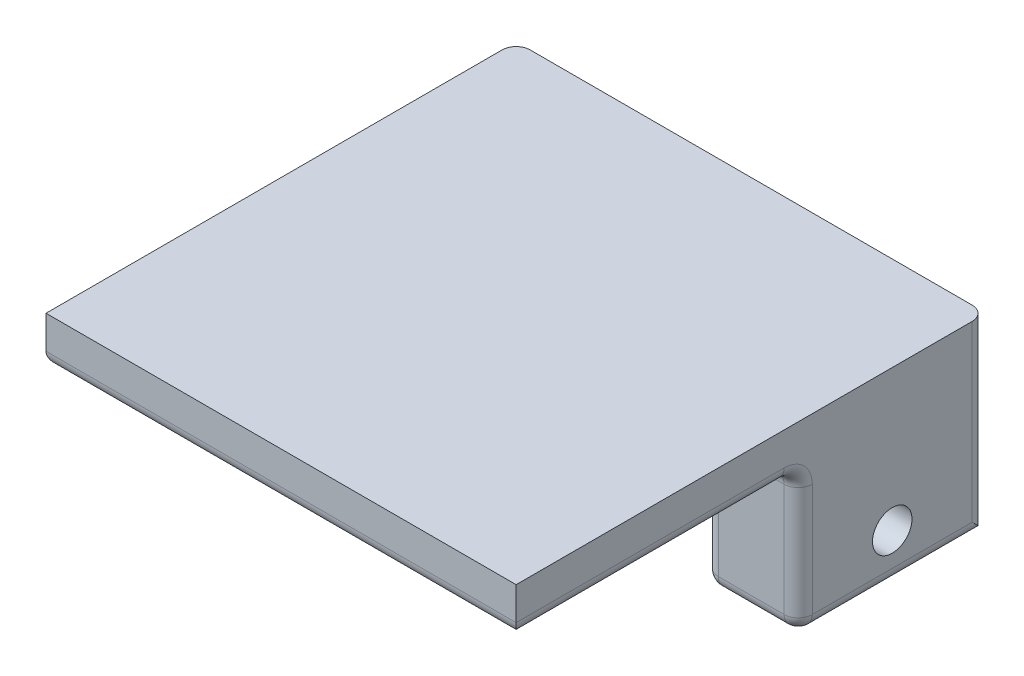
ISO-10303-21;
HEADER;
FILE_DESCRIPTION(('STEP AP214'),'2;1');
FILE_NAME('part.step','',(''),(''),'','','');
FILE_SCHEMA(('AUTOMOTIVE_DESIGN { 1 0 10303 214 1 1 1 1 }'));
ENDSEC;
DATA;
#1=APPLICATION_CONTEXT('core data for automotive mechanical design processes');
#2=APPLICATION_PROTOCOL_DEFINITION('international standard','automotive_design',2000,#1);
#3=PRODUCT_CONTEXT('',#1,'mechanical');
#4=PRODUCT('Part','Part','',(#3));
#5=PRODUCT_RELATED_PRODUCT_CATEGORY('part','',(#4));
#6=PRODUCT_DEFINITION_FORMATION('','',#4);
#7=PRODUCT_DEFINITION_CONTEXT('part definition',#1,'design');
#8=PRODUCT_DEFINITION('design','',#6,#7);
#9=PRODUCT_DEFINITION_SHAPE('','',#8);
#10=(LENGTH_UNIT() NAMED_UNIT(*) SI_UNIT(.MILLI.,.METRE.));
#11=(NAMED_UNIT(*) PLANE_ANGLE_UNIT() SI_UNIT($,.RADIAN.));
#12=(NAMED_UNIT(*) SI_UNIT($,.STERADIAN.) SOLID_ANGLE_UNIT());
#13=UNCERTAINTY_MEASURE_WITH_UNIT(LENGTH_MEASURE(1.E-05),#10,'distance_accuracy_value','');
#14=(GEOMETRIC_REPRESENTATION_CONTEXT(3) GLOBAL_UNCERTAINTY_ASSIGNED_CONTEXT((#13)) GLOBAL_UNIT_ASSIGNED_CONTEXT((#10,
#11,#12)) REPRESENTATION_CONTEXT('',''));
#15=CARTESIAN_POINT('',(0.,0.,0.));
#16=DIRECTION('',(0.,0.,1.));
#17=DIRECTION('',(1.,0.,0.));
#18=AXIS2_PLACEMENT_3D('',#15,#16,#17);
#19=CARTESIAN_POINT('',(0.,0.,0.));
#20=DIRECTION('',(0.,1.,0.));
#21=DIRECTION('',(0.,0.,1.));
#22=AXIS2_PLACEMENT_3D('',#19,#20,#21);
#23=PLANE('',#22);
#24=DIRECTION('',(0.,0.,-1.));
#25=VECTOR('',#24,1.);
#26=CARTESIAN_POINT('',(0.499999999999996,0.,-25.));
#27=LINE('',#26,#25);
#28=CARTESIAN_POINT('',(0.500000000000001,0.,23.5));
#29=VERTEX_POINT('',#28);
#30=CARTESIAN_POINT('',(0.499999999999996,0.,-23.5));
#31=VERTEX_POINT('',#30);
#32=EDGE_CURVE('E503',#29,#31,#27,.T.);
#33=ORIENTED_EDGE('',*,*,#32,.T.);
#34=DIRECTION('',(-1.,0.,0.));
#35=VECTOR('',#34,1.);
#36=CARTESIAN_POINT('',(0.,0.,-23.5));
#37=LINE('',#36,#35);
#38=CARTESIAN_POINT('',(13.5,0.,-23.5));
#39=VERTEX_POINT('',#38);
#40=EDGE_CURVE('E342',#31,#39,#37,.F.);
#41=ORIENTED_EDGE('',*,*,#40,.T.);
#42=DIRECTION('',(0.,0.,-1.));
#43=VECTOR('',#42,1.);
#44=CARTESIAN_POINT('',(13.5,0.,-5.));
#45=LINE('',#44,#43);
#46=CARTESIAN_POINT('',(13.5,0.,-6.5));
#47=VERTEX_POINT('',#46);
#48=EDGE_CURVE('E340',#39,#47,#45,.F.);
#49=ORIENTED_EDGE('',*,*,#48,.T.);
#50=CARTESIAN_POINT('',(16.5,0.,-6.5));
#51=DIRECTION('',(0.,1.,0.));
#52=DIRECTION('',(0.,0.,1.));
#53=AXIS2_PLACEMENT_3D('',#50,#51,#52);
#54=CIRCLE('',#53,3.);
#55=CARTESIAN_POINT('',(16.5,0.,-3.5));
#56=VERTEX_POINT('',#55);
#57=EDGE_CURVE('E337',#56,#47,#54,.F.);
#58=ORIENTED_EDGE('',*,*,#57,.F.);
#59=DIRECTION('',(-1.,0.,0.));
#60=VECTOR('',#59,1.);
#61=CARTESIAN_POINT('',(25.,0.,-3.49999999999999));
#62=LINE('',#61,#60);
#63=CARTESIAN_POINT('',(23.5,0.,-3.5));
#64=VERTEX_POINT('',#63);
#65=EDGE_CURVE('E333',#56,#64,#62,.F.);
#66=ORIENTED_EDGE('',*,*,#65,.T.);
#67=DIRECTION('',(0.,0.,-1.));
#68=VECTOR('',#67,1.);
#69=CARTESIAN_POINT('',(23.5,0.,0.));
#70=LINE('',#69,#68);
#71=CARTESIAN_POINT('',(23.5,0.,23.5));
#72=VERTEX_POINT('',#71);
#73=EDGE_CURVE('E331',#64,#72,#70,.F.);
#74=ORIENTED_EDGE('',*,*,#73,.T.);
#75=DIRECTION('',(1.,0.,0.));
#76=VECTOR('',#75,1.);
#77=CARTESIAN_POINT('',(0.,0.,23.5));
#78=LINE('',#77,#76);
#79=EDGE_CURVE('E335',#72,#29,#78,.F.);
#80=ORIENTED_EDGE('',*,*,#79,.T.);
#81=EDGE_LOOP('',(#33,#41,#49,#58,#66,#74,#80));
#82=FACE_BOUND('',#81,.T.);
#83=ADVANCED_FACE('F38',(#82),#23,.F.);
#84=DIRECTION('',(0.,0.,1.));
#85=VECTOR('',#84,1.);
#86=CARTESIAN_POINT('',(-13.5,0.,-25.));
#87=LINE('',#86,#85);
#88=CARTESIAN_POINT('',(-13.5,0.,-6.5));
#89=VERTEX_POINT('',#88);
#90=CARTESIAN_POINT('',(-13.5,0.,-23.5));
#91=VERTEX_POINT('',#90);
#92=EDGE_CURVE('E299',#89,#91,#87,.F.);
#93=ORIENTED_EDGE('',*,*,#92,.T.);
#94=DIRECTION('',(-1.,0.,0.));
#95=VECTOR('',#94,1.);
#96=CARTESIAN_POINT('',(0.,0.,-23.5));
#97=LINE('',#96,#95);
#98=CARTESIAN_POINT('',(-0.499999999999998,0.,-23.5));
#99=VERTEX_POINT('',#98);
#100=EDGE_CURVE('E301',#91,#99,#97,.F.);
#101=ORIENTED_EDGE('',*,*,#100,.T.);
#102=DIRECTION('',(0.,0.,1.));
#103=VECTOR('',#102,1.);
#104=CARTESIAN_POINT('',(-0.499999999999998,0.,25.));
#105=LINE('',#104,#103);
#106=CARTESIAN_POINT('',(-0.499999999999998,0.,23.5));
#107=VERTEX_POINT('',#106);
#108=EDGE_CURVE('E508',#99,#107,#105,.T.);
#109=ORIENTED_EDGE('',*,*,#108,.T.);
#110=DIRECTION('',(1.,0.,0.));
#111=VECTOR('',#110,1.);
#112=CARTESIAN_POINT('',(-12.75,0.,23.5));
#113=LINE('',#112,#111);
#114=CARTESIAN_POINT('',(-23.5,0.,23.5));
#115=VERTEX_POINT('',#114);
#116=EDGE_CURVE('E292',#107,#115,#113,.F.);
#117=ORIENTED_EDGE('',*,*,#116,.T.);
#118=DIRECTION('',(0.,0.,1.));
#119=VECTOR('',#118,1.);
#120=CARTESIAN_POINT('',(-23.5,0.,0.));
#121=LINE('',#120,#119);
#122=CARTESIAN_POINT('',(-23.5,0.,-3.5));
#123=VERTEX_POINT('',#122);
#124=EDGE_CURVE('E290',#115,#123,#121,.F.);
#125=ORIENTED_EDGE('',*,*,#124,.T.);
#126=DIRECTION('',(-1.,0.,0.));
#127=VECTOR('',#126,1.);
#128=CARTESIAN_POINT('',(-15.,0.,-3.5));
#129=LINE('',#128,#127);
#130=CARTESIAN_POINT('',(-16.5,0.,-3.5));
#131=VERTEX_POINT('',#130);
#132=EDGE_CURVE('E294',#123,#131,#129,.F.);
#133=ORIENTED_EDGE('',*,*,#132,.T.);
#134=CARTESIAN_POINT('',(-16.5,0.,-6.5));
#135=DIRECTION('',(0.,1.,0.));
#136=DIRECTION('',(0.,0.,1.));
#137=AXIS2_PLACEMENT_3D('',#134,#135,#136);
#138=CIRCLE('',#137,3.);
#139=EDGE_CURVE('E296',#89,#131,#138,.F.);
#140=ORIENTED_EDGE('',*,*,#139,.F.);
#141=EDGE_LOOP('',(#93,#101,#109,#117,#125,#133,#140));
#142=FACE_BOUND('',#141,.T.);
#143=ADVANCED_FACE('F597',(#142),#23,.F.);
#144=CARTESIAN_POINT('',(-25.,5.,-25.));
#145=DIRECTION('',(0.,0.,1.));
#146=DIRECTION('',(1.,0.,0.));
#147=AXIS2_PLACEMENT_3D('',#144,#145,#146);
#148=PLANE('',#147);
#149=DIRECTION('',(1.,0.,0.));
#150=VECTOR('',#149,1.);
#151=CARTESIAN_POINT('',(-25.,-15.,-25.));
#152=LINE('',#151,#150);
#153=CARTESIAN_POINT('',(-23.5,-15.,-25.));
#154=VERTEX_POINT('',#153);
#155=CARTESIAN_POINT('',(-16.5,-15.,-25.));
#156=VERTEX_POINT('',#155);
#157=EDGE_CURVE('E530',#154,#156,#152,.T.);
#158=ORIENTED_EDGE('',*,*,#157,.F.);
#159=DIRECTION('',(0.,-1.,0.));
#160=VECTOR('',#159,1.);
#161=CARTESIAN_POINT('',(-23.5,5.,-25.));
#162=LINE('',#161,#160);
#163=CARTESIAN_POINT('',(-23.5,5.,-25.));
#164=VERTEX_POINT('',#163);
#165=EDGE_CURVE('E288',#154,#164,#162,.F.);
#166=ORIENTED_EDGE('',*,*,#165,.T.);
#167=DIRECTION('',(-1.,0.,0.));
#168=VECTOR('',#167,1.);
#169=CARTESIAN_POINT('',(-25.,5.,-25.));
#170=LINE('',#169,#168);
#171=CARTESIAN_POINT('',(23.5,5.,-25.));
#172=VERTEX_POINT('',#171);
#173=EDGE_CURVE('E250',#172,#164,#170,.T.);
#174=ORIENTED_EDGE('',*,*,#173,.F.);
#175=DIRECTION('',(0.,-1.,0.));
#176=VECTOR('',#175,1.);
#177=CARTESIAN_POINT('',(23.5,5.,-25.));
#178=LINE('',#177,#176);
#179=CARTESIAN_POINT('',(23.5,-15.,-25.));
#180=VERTEX_POINT('',#179);
#181=EDGE_CURVE('E259',#172,#180,#178,.T.);
#182=ORIENTED_EDGE('',*,*,#181,.T.);
#183=DIRECTION('',(1.,0.,0.));
#184=VECTOR('',#183,1.);
#185=CARTESIAN_POINT('',(25.,-15.,-25.));
#186=LINE('',#185,#184);
#187=CARTESIAN_POINT('',(16.5,-15.,-25.));
#188=VERTEX_POINT('',#187);
#189=EDGE_CURVE('E527',#188,#180,#186,.T.);
#190=ORIENTED_EDGE('',*,*,#189,.F.);
#191=DIRECTION('',(0.,1.,0.));
#192=VECTOR('',#191,1.);
#193=CARTESIAN_POINT('',(16.5,5.,-25.));
#194=LINE('',#193,#192);
#195=CARTESIAN_POINT('',(16.5,-1.5,-25.));
#196=VERTEX_POINT('',#195);
#197=EDGE_CURVE('E286',#188,#196,#194,.T.);
#198=ORIENTED_EDGE('',*,*,#197,.T.);
#199=CARTESIAN_POINT('',(13.5,-1.5,-25.));
#200=DIRECTION('',(0.,0.,1.));
#201=DIRECTION('',(1.,0.,0.));
#202=AXIS2_PLACEMENT_3D('',#199,#200,#201);
#203=CIRCLE('',#202,3.);
#204=CARTESIAN_POINT('',(13.5,1.5,-25.));
#205=VERTEX_POINT('',#204);
#206=EDGE_CURVE('E283',#205,#196,#203,.F.);
#207=ORIENTED_EDGE('',*,*,#206,.F.);
#208=DIRECTION('',(-1.,0.,0.));
#209=VECTOR('',#208,1.);
#210=CARTESIAN_POINT('',(-25.,1.5,-25.));
#211=LINE('',#210,#209);
#212=CARTESIAN_POINT('',(-13.5,1.5,-25.));
#213=VERTEX_POINT('',#212);
#214=EDGE_CURVE('E280',#205,#213,#211,.T.);
#215=ORIENTED_EDGE('',*,*,#214,.T.);
#216=CARTESIAN_POINT('',(-13.5,-1.5,-25.));
#217=DIRECTION('',(0.,0.,1.));
#218=DIRECTION('',(1.,0.,0.));
#219=AXIS2_PLACEMENT_3D('',#216,#217,#218);
#220=CIRCLE('',#219,3.);
#221=CARTESIAN_POINT('',(-16.5,-1.5,-25.));
#222=VERTEX_POINT('',#221);
#223=EDGE_CURVE('E277',#222,#213,#220,.F.);
#224=ORIENTED_EDGE('',*,*,#223,.F.);
#225=DIRECTION('',(0.,1.,0.));
#226=VECTOR('',#225,1.);
#227=CARTESIAN_POINT('',(-16.5,5.,-25.));
#228=LINE('',#227,#226);
#229=EDGE_CURVE('E275',#222,#156,#228,.F.);
#230=ORIENTED_EDGE('',*,*,#229,.T.);
#231=EDGE_LOOP('',(#158,#166,#174,#182,#190,#198,#207,#215,#224,#230));
#232=FACE_BOUND('',#231,.T.);
#233=ADVANCED_FACE('F595',(#232),#148,.F.);
#234=CARTESIAN_POINT('',(-25.,5.,25.));
#235=DIRECTION('',(0.,0.,-1.));
#236=DIRECTION('',(-1.,0.,0.));
#237=AXIS2_PLACEMENT_3D('',#234,#235,#236);
#238=PLANE('',#237);
#239=DIRECTION('',(0.,-1.,0.));
#240=VECTOR('',#239,1.);
#241=CARTESIAN_POINT('',(-25.,5.,25.));
#242=LINE('',#241,#240);
#243=CARTESIAN_POINT('',(-25.,5.,25.));
#244=VERTEX_POINT('',#243);
#245=CARTESIAN_POINT('',(-25.,1.5,25.));
#246=VERTEX_POINT('',#245);
#247=EDGE_CURVE('E253',#244,#246,#242,.T.);
#248=ORIENTED_EDGE('',*,*,#247,.T.);
#249=DIRECTION('',(1.,0.,0.));
#250=VECTOR('',#249,1.);
#251=CARTESIAN_POINT('',(-25.,1.5,25.));
#252=LINE('',#251,#250);
#253=CARTESIAN_POINT('',(25.,1.5,25.));
#254=VERTEX_POINT('',#253);
#255=EDGE_CURVE('E360',#246,#254,#252,.T.);
#256=ORIENTED_EDGE('',*,*,#255,.T.);
#257=DIRECTION('',(0.,-1.,0.));
#258=VECTOR('',#257,1.);
#259=CARTESIAN_POINT('',(25.,5.,25.));
#260=LINE('',#259,#258);
#261=CARTESIAN_POINT('',(25.,5.,25.));
#262=VERTEX_POINT('',#261);
#263=EDGE_CURVE('E260',#262,#254,#260,.T.);
#264=ORIENTED_EDGE('',*,*,#263,.F.);
#265=DIRECTION('',(1.,0.,0.));
#266=VECTOR('',#265,1.);
#267=CARTESIAN_POINT('',(-25.,5.,25.));
#268=LINE('',#267,#266);
#269=EDGE_CURVE('E244',#244,#262,#268,.T.);
#270=ORIENTED_EDGE('',*,*,#269,.F.);
#271=EDGE_LOOP('',(#248,#256,#264,#270));
#272=FACE_BOUND('',#271,.T.);
#273=ADVANCED_FACE('F262',(#272),#238,.F.);
#274=CARTESIAN_POINT('',(25.,5.,-25.));
#275=DIRECTION('',(-1.,0.,0.));
#276=DIRECTION('',(0.,0.,1.));
#277=AXIS2_PLACEMENT_3D('',#274,#275,#276);
#278=PLANE('',#277);
#279=CARTESIAN_POINT('',(25.,-10.,-15.));
#280=DIRECTION('',(-1.,0.,0.));
#281=DIRECTION('',(0.,0.,1.));
#282=AXIS2_PLACEMENT_3D('',#279,#280,#281);
#283=CIRCLE('',#282,2.1);
#284=CARTESIAN_POINT('',(25.,-10.,-12.9));
#285=VERTEX_POINT('',#284);
#286=EDGE_CURVE('E524',#285,#285,#283,.T.);
#287=ORIENTED_EDGE('',*,*,#286,.T.);
#288=EDGE_LOOP('',(#287));
#289=FACE_BOUND('',#288,.T.);
#290=DIRECTION('',(0.,0.,1.));
#291=VECTOR('',#290,1.);
#292=CARTESIAN_POINT('',(25.,-13.5,-25.));
#293=LINE('',#292,#291);
#294=CARTESIAN_POINT('',(25.,-13.5,-6.5));
#295=VERTEX_POINT('',#294);
#296=CARTESIAN_POINT('',(25.,-13.5,-23.5));
#297=VERTEX_POINT('',#296);
#298=EDGE_CURVE('E47',#295,#297,#293,.F.);
#299=ORIENTED_EDGE('',*,*,#298,.T.);
#300=DIRECTION('',(0.,-1.,0.));
#301=VECTOR('',#300,1.);
#302=CARTESIAN_POINT('',(25.,5.,-23.5));
#303=LINE('',#302,#301);
#304=CARTESIAN_POINT('',(25.,5.,-23.5));
#305=VERTEX_POINT('',#304);
#306=EDGE_CURVE('E11',#297,#305,#303,.F.);
#307=ORIENTED_EDGE('',*,*,#306,.T.);
#308=DIRECTION('',(0.,0.,-1.));
#309=VECTOR('',#308,1.);
#310=CARTESIAN_POINT('',(25.,5.,-25.));
#311=LINE('',#310,#309);
#312=EDGE_CURVE('E533',#262,#305,#311,.T.);
#313=ORIENTED_EDGE('',*,*,#312,.F.);
#314=ORIENTED_EDGE('',*,*,#263,.T.);
#315=DIRECTION('',(0.,0.,-1.));
#316=VECTOR('',#315,1.);
#317=CARTESIAN_POINT('',(25.,1.5,-25.));
#318=LINE('',#317,#316);
#319=CARTESIAN_POINT('',(25.,1.5,-3.5));
#320=VERTEX_POINT('',#319);
#321=EDGE_CURVE('E396',#254,#320,#318,.T.);
#322=ORIENTED_EDGE('',*,*,#321,.T.);
#323=CARTESIAN_POINT('',(25.,-1.5,-3.5));
#324=DIRECTION('',(-1.,0.,0.));
#325=DIRECTION('',(0.,0.,1.));
#326=AXIS2_PLACEMENT_3D('',#323,#324,#325);
#327=CIRCLE('',#326,3.);
#328=CARTESIAN_POINT('',(25.,-1.5,-6.5));
#329=VERTEX_POINT('',#328);
#330=EDGE_CURVE('E393',#329,#320,#327,.F.);
#331=ORIENTED_EDGE('',*,*,#330,.F.);
#332=DIRECTION('',(0.,1.,0.));
#333=VECTOR('',#332,1.);
#334=CARTESIAN_POINT('',(25.,5.,-6.5));
#335=LINE('',#334,#333);
#336=EDGE_CURVE('E58',#329,#295,#335,.F.);
#337=ORIENTED_EDGE('',*,*,#336,.T.);
#338=EDGE_LOOP('',(#299,#307,#313,#314,#322,#331,#337));
#339=FACE_BOUND('',#338,.T.);
#340=ADVANCED_FACE('F572',(#289,#339),#278,.F.);
#341=CARTESIAN_POINT('',(-25.,5.,-25.));
#342=DIRECTION('',(1.,0.,0.));
#343=DIRECTION('',(0.,0.,-1.));
#344=AXIS2_PLACEMENT_3D('',#341,#342,#343);
#345=PLANE('',#344);
#346=CARTESIAN_POINT('',(-25.,-10.,-15.));
#347=DIRECTION('',(1.,0.,0.));
#348=DIRECTION('',(0.,0.,-1.));
#349=AXIS2_PLACEMENT_3D('',#346,#347,#348);
#350=CIRCLE('',#349,2.1);
#351=CARTESIAN_POINT('',(-25.,-10.,-17.1));
#352=VERTEX_POINT('',#351);
#353=EDGE_CURVE('E273',#352,#352,#350,.T.);
#354=ORIENTED_EDGE('',*,*,#353,.T.);
#355=EDGE_LOOP('',(#354));
#356=FACE_BOUND('',#355,.T.);
#357=CARTESIAN_POINT('',(-25.,-1.5,-3.5));
#358=DIRECTION('',(1.,0.,0.));
#359=DIRECTION('',(0.,0.,-1.));
#360=AXIS2_PLACEMENT_3D('',#357,#358,#359);
#361=CIRCLE('',#360,3.);
#362=CARTESIAN_POINT('',(-25.,1.5,-3.5));
#363=VERTEX_POINT('',#362);
#364=CARTESIAN_POINT('',(-25.,-1.5,-6.5));
#365=VERTEX_POINT('',#364);
#366=EDGE_CURVE('E356',#363,#365,#361,.F.);
#367=ORIENTED_EDGE('',*,*,#366,.F.);
#368=DIRECTION('',(0.,0.,1.));
#369=VECTOR('',#368,1.);
#370=CARTESIAN_POINT('',(-25.,1.5,-25.));
#371=LINE('',#370,#369);
#372=EDGE_CURVE('E256',#363,#246,#371,.T.);
#373=ORIENTED_EDGE('',*,*,#372,.T.);
#374=ORIENTED_EDGE('',*,*,#247,.F.);
#375=DIRECTION('',(0.,0.,1.));
#376=VECTOR('',#375,1.);
#377=CARTESIAN_POINT('',(-25.,5.,-25.));
#378=LINE('',#377,#376);
#379=CARTESIAN_POINT('',(-25.,5.,-23.5));
#380=VERTEX_POINT('',#379);
#381=EDGE_CURVE('E238',#380,#244,#378,.T.);
#382=ORIENTED_EDGE('',*,*,#381,.F.);
#383=DIRECTION('',(0.,-1.,0.));
#384=VECTOR('',#383,1.);
#385=CARTESIAN_POINT('',(-25.,5.,-23.5));
#386=LINE('',#385,#384);
#387=CARTESIAN_POINT('',(-25.,-13.5,-23.5));
#388=VERTEX_POINT('',#387);
#389=EDGE_CURVE('E350',#380,#388,#386,.T.);
#390=ORIENTED_EDGE('',*,*,#389,.T.);
#391=DIRECTION('',(0.,0.,-1.));
#392=VECTOR('',#391,1.);
#393=CARTESIAN_POINT('',(-25.,-13.5,-5.));
#394=LINE('',#393,#392);
#395=CARTESIAN_POINT('',(-25.,-13.5,-6.5));
#396=VERTEX_POINT('',#395);
#397=EDGE_CURVE('E352',#388,#396,#394,.F.);
#398=ORIENTED_EDGE('',*,*,#397,.T.);
#399=DIRECTION('',(0.,1.,0.));
#400=VECTOR('',#399,1.);
#401=CARTESIAN_POINT('',(-25.,5.,-6.5));
#402=LINE('',#401,#400);
#403=EDGE_CURVE('E354',#396,#365,#402,.T.);
#404=ORIENTED_EDGE('',*,*,#403,.T.);
#405=EDGE_LOOP('',(#367,#373,#374,#382,#390,#398,#404));
#406=FACE_BOUND('',#405,.T.);
#407=ADVANCED_FACE('F254',(#356,#406),#345,.F.);
#408=CARTESIAN_POINT('',(0.,5.,0.));
#409=DIRECTION('',(0.,1.,0.));
#410=DIRECTION('',(0.,0.,1.));
#411=AXIS2_PLACEMENT_3D('',#408,#409,#410);
#412=PLANE('',#411);
#413=ORIENTED_EDGE('',*,*,#173,.T.);
#414=CARTESIAN_POINT('',(-23.5,5.,-23.5));
#415=DIRECTION('',(0.,1.,0.));
#416=DIRECTION('',(0.,0.,1.));
#417=AXIS2_PLACEMENT_3D('',#414,#415,#416);
#418=CIRCLE('',#417,1.5);
#419=EDGE_CURVE('E247',#164,#380,#418,.T.);
#420=ORIENTED_EDGE('',*,*,#419,.T.);
#421=ORIENTED_EDGE('',*,*,#381,.T.);
#422=ORIENTED_EDGE('',*,*,#269,.T.);
#423=ORIENTED_EDGE('',*,*,#312,.T.);
#424=CARTESIAN_POINT('',(23.5,5.,-23.5));
#425=DIRECTION('',(0.,1.,0.));
#426=DIRECTION('',(0.,0.,1.));
#427=AXIS2_PLACEMENT_3D('',#424,#425,#426);
#428=CIRCLE('',#427,1.5);
#429=EDGE_CURVE('E390',#305,#172,#428,.T.);
#430=ORIENTED_EDGE('',*,*,#429,.T.);
#431=EDGE_LOOP('',(#413,#420,#421,#422,#423,#430));
#432=FACE_BOUND('',#431,.T.);
#433=ADVANCED_FACE('F241',(#432),#412,.T.);
#434=CARTESIAN_POINT('',(-15.,-15.,-5.));
#435=DIRECTION('',(-1.,0.,0.));
#436=DIRECTION('',(0.,0.,1.));
#437=AXIS2_PLACEMENT_3D('',#434,#435,#436);
#438=PLANE('',#437);
#439=DIRECTION('',(0.,1.,0.));
#440=VECTOR('',#439,1.);
#441=CARTESIAN_POINT('',(-15.,-15.,-23.5));
#442=LINE('',#441,#440);
#443=CARTESIAN_POINT('',(-15.,-13.5,-23.5));
#444=VERTEX_POINT('',#443);
#445=CARTESIAN_POINT('',(-15.,-1.5,-23.5));
#446=VERTEX_POINT('',#445);
#447=EDGE_CURVE('E366',#444,#446,#442,.T.);
#448=ORIENTED_EDGE('',*,*,#447,.T.);
#449=DIRECTION('',(0.,0.,1.));
#450=VECTOR('',#449,1.);
#451=CARTESIAN_POINT('',(-15.,-1.5,-5.));
#452=LINE('',#451,#450);
#453=CARTESIAN_POINT('',(-15.,-1.5,-6.5));
#454=VERTEX_POINT('',#453);
#455=EDGE_CURVE('E372',#446,#454,#452,.T.);
#456=ORIENTED_EDGE('',*,*,#455,.T.);
#457=DIRECTION('',(0.,1.,0.));
#458=VECTOR('',#457,1.);
#459=CARTESIAN_POINT('',(-15.,-15.,-6.5));
#460=LINE('',#459,#458);
#461=CARTESIAN_POINT('',(-15.,-13.5,-6.5));
#462=VERTEX_POINT('',#461);
#463=EDGE_CURVE('E370',#454,#462,#460,.F.);
#464=ORIENTED_EDGE('',*,*,#463,.T.);
#465=DIRECTION('',(0.,0.,1.));
#466=VECTOR('',#465,1.);
#467=CARTESIAN_POINT('',(-15.,-13.5,-25.));
#468=LINE('',#467,#466);
#469=EDGE_CURVE('E368',#462,#444,#468,.F.);
#470=ORIENTED_EDGE('',*,*,#469,.T.);
#471=EDGE_LOOP('',(#448,#456,#464,#470));
#472=FACE_BOUND('',#471,.T.);
#473=CARTESIAN_POINT('',(-15.,-10.,-15.));
#474=DIRECTION('',(-1.,0.,0.));
#475=DIRECTION('',(0.,0.,1.));
#476=AXIS2_PLACEMENT_3D('',#473,#474,#475);
#477=CIRCLE('',#476,2.1);
#478=CARTESIAN_POINT('',(-15.,-10.,-12.9));
#479=VERTEX_POINT('',#478);
#480=EDGE_CURVE('E272',#479,#479,#477,.T.);
#481=ORIENTED_EDGE('',*,*,#480,.T.);
#482=EDGE_LOOP('',(#481));
#483=FACE_BOUND('',#482,.T.);
#484=ADVANCED_FACE('F619',(#472,#483),#438,.F.);
#485=CARTESIAN_POINT('',(-25.,-15.,-5.));
#486=DIRECTION('',(0.,0.,-1.));
#487=DIRECTION('',(-1.,0.,0.));
#488=AXIS2_PLACEMENT_3D('',#485,#486,#487);
#489=PLANE('',#488);
#490=DIRECTION('',(-1.,0.,0.));
#491=VECTOR('',#490,1.);
#492=CARTESIAN_POINT('',(-15.,-13.5,-5.));
#493=LINE('',#492,#491);
#494=CARTESIAN_POINT('',(-23.5,-13.5,-5.));
#495=VERTEX_POINT('',#494);
#496=CARTESIAN_POINT('',(-16.5,-13.5,-5.));
#497=VERTEX_POINT('',#496);
#498=EDGE_CURVE('E315',#495,#497,#493,.F.);
#499=ORIENTED_EDGE('',*,*,#498,.T.);
#500=DIRECTION('',(0.,1.,0.));
#501=VECTOR('',#500,1.);
#502=CARTESIAN_POINT('',(-16.5,-15.,-5.));
#503=LINE('',#502,#501);
#504=CARTESIAN_POINT('',(-16.5,-1.5,-5.));
#505=VERTEX_POINT('',#504);
#506=EDGE_CURVE('E320',#497,#505,#503,.T.);
#507=ORIENTED_EDGE('',*,*,#506,.T.);
#508=DIRECTION('',(-1.,0.,0.));
#509=VECTOR('',#508,1.);
#510=CARTESIAN_POINT('',(-25.,-1.5,-5.));
#511=LINE('',#510,#509);
#512=CARTESIAN_POINT('',(-23.5,-1.5,-5.));
#513=VERTEX_POINT('',#512);
#514=EDGE_CURVE('E317',#505,#513,#511,.T.);
#515=ORIENTED_EDGE('',*,*,#514,.T.);
#516=DIRECTION('',(0.,1.,0.));
#517=VECTOR('',#516,1.);
#518=CARTESIAN_POINT('',(-23.5,-15.,-5.));
#519=LINE('',#518,#517);
#520=EDGE_CURVE('E313',#513,#495,#519,.F.);
#521=ORIENTED_EDGE('',*,*,#520,.T.);
#522=EDGE_LOOP('',(#499,#507,#515,#521));
#523=FACE_BOUND('',#522,.T.);
#524=ADVANCED_FACE('F632',(#523),#489,.F.);
#525=CARTESIAN_POINT('',(0.,-15.,0.));
#526=DIRECTION('',(0.,-1.,0.));
#527=DIRECTION('',(0.,0.,-1.));
#528=AXIS2_PLACEMENT_3D('',#525,#526,#527);
#529=PLANE('',#528);
#530=DIRECTION('',(-1.,0.,0.));
#531=VECTOR('',#530,1.);
#532=CARTESIAN_POINT('',(-25.,-15.,-6.5));
#533=LINE('',#532,#531);
#534=CARTESIAN_POINT('',(-16.5,-15.,-6.5));
#535=VERTEX_POINT('',#534);
#536=CARTESIAN_POINT('',(-23.5,-15.,-6.5));
#537=VERTEX_POINT('',#536);
#538=EDGE_CURVE('E346',#535,#537,#533,.T.);
#539=ORIENTED_EDGE('',*,*,#538,.T.);
#540=DIRECTION('',(0.,0.,-1.));
#541=VECTOR('',#540,1.);
#542=CARTESIAN_POINT('',(-23.5,-15.,-25.));
#543=LINE('',#542,#541);
#544=EDGE_CURVE('E348',#537,#154,#543,.T.);
#545=ORIENTED_EDGE('',*,*,#544,.T.);
#546=ORIENTED_EDGE('',*,*,#157,.T.);
#547=DIRECTION('',(0.,0.,1.));
#548=VECTOR('',#547,1.);
#549=CARTESIAN_POINT('',(-16.5,-15.,-5.));
#550=LINE('',#549,#548);
#551=EDGE_CURVE('E344',#156,#535,#550,.T.);
#552=ORIENTED_EDGE('',*,*,#551,.T.);
#553=EDGE_LOOP('',(#539,#545,#546,#552));
#554=FACE_BOUND('',#553,.T.);
#555=ADVANCED_FACE('F637',(#554),#529,.T.);
#556=CARTESIAN_POINT('',(25.,-15.,-4.99999999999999));
#557=DIRECTION('',(0.,0.,-1.));
#558=DIRECTION('',(-1.,0.,0.));
#559=AXIS2_PLACEMENT_3D('',#556,#557,#558);
#560=PLANE('',#559);
#561=DIRECTION('',(0.,1.,0.));
#562=VECTOR('',#561,1.);
#563=CARTESIAN_POINT('',(16.5,-15.,-5.));
#564=LINE('',#563,#562);
#565=CARTESIAN_POINT('',(16.5,-1.5,-5.));
#566=VERTEX_POINT('',#565);
#567=CARTESIAN_POINT('',(16.5,-13.5,-5.));
#568=VERTEX_POINT('',#567);
#569=EDGE_CURVE('E385',#566,#568,#564,.F.);
#570=ORIENTED_EDGE('',*,*,#569,.T.);
#571=DIRECTION('',(-1.,0.,0.));
#572=VECTOR('',#571,1.);
#573=CARTESIAN_POINT('',(25.,-13.5,-4.99999999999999));
#574=LINE('',#573,#572);
#575=CARTESIAN_POINT('',(23.5,-13.5,-5.));
#576=VERTEX_POINT('',#575);
#577=EDGE_CURVE('E387',#568,#576,#574,.F.);
#578=ORIENTED_EDGE('',*,*,#577,.T.);
#579=DIRECTION('',(0.,1.,0.));
#580=VECTOR('',#579,1.);
#581=CARTESIAN_POINT('',(23.5,-15.,-5.));
#582=LINE('',#581,#580);
#583=CARTESIAN_POINT('',(23.5,-1.5,-5.));
#584=VERTEX_POINT('',#583);
#585=EDGE_CURVE('E381',#576,#584,#582,.T.);
#586=ORIENTED_EDGE('',*,*,#585,.T.);
#587=DIRECTION('',(-1.,0.,0.));
#588=VECTOR('',#587,1.);
#589=CARTESIAN_POINT('',(15.,-1.5,-5.));
#590=LINE('',#589,#588);
#591=EDGE_CURVE('E383',#584,#566,#590,.T.);
#592=ORIENTED_EDGE('',*,*,#591,.T.);
#593=EDGE_LOOP('',(#570,#578,#586,#592));
#594=FACE_BOUND('',#593,.T.);
#595=ADVANCED_FACE('F643',(#594),#560,.F.);
#596=CARTESIAN_POINT('',(15.,-15.,-5.));
#597=DIRECTION('',(1.,0.,0.));
#598=DIRECTION('',(0.,0.,-1.));
#599=AXIS2_PLACEMENT_3D('',#596,#597,#598);
#600=PLANE('',#599);
#601=DIRECTION('',(0.,1.,0.));
#602=VECTOR('',#601,1.);
#603=CARTESIAN_POINT('',(15.,-15.,-6.5));
#604=LINE('',#603,#602);
#605=CARTESIAN_POINT('',(15.,-13.5,-6.5));
#606=VERTEX_POINT('',#605);
#607=CARTESIAN_POINT('',(15.,-1.5,-6.5));
#608=VERTEX_POINT('',#607);
#609=EDGE_CURVE('E322',#606,#608,#604,.T.);
#610=ORIENTED_EDGE('',*,*,#609,.T.);
#611=DIRECTION('',(0.,0.,-1.));
#612=VECTOR('',#611,1.);
#613=CARTESIAN_POINT('',(15.,-1.5,-25.));
#614=LINE('',#613,#612);
#615=CARTESIAN_POINT('',(15.,-1.5,-23.5));
#616=VERTEX_POINT('',#615);
#617=EDGE_CURVE('E328',#608,#616,#614,.T.);
#618=ORIENTED_EDGE('',*,*,#617,.T.);
#619=DIRECTION('',(0.,1.,0.));
#620=VECTOR('',#619,1.);
#621=CARTESIAN_POINT('',(15.,-15.,-23.5));
#622=LINE('',#621,#620);
#623=CARTESIAN_POINT('',(15.,-13.5,-23.5));
#624=VERTEX_POINT('',#623);
#625=EDGE_CURVE('E326',#616,#624,#622,.F.);
#626=ORIENTED_EDGE('',*,*,#625,.T.);
#627=DIRECTION('',(0.,0.,-1.));
#628=VECTOR('',#627,1.);
#629=CARTESIAN_POINT('',(15.,-13.5,-5.));
#630=LINE('',#629,#628);
#631=EDGE_CURVE('E324',#624,#606,#630,.F.);
#632=ORIENTED_EDGE('',*,*,#631,.T.);
#633=EDGE_LOOP('',(#610,#618,#626,#632));
#634=FACE_BOUND('',#633,.T.);
#635=CARTESIAN_POINT('',(15.,-10.,-15.));
#636=DIRECTION('',(1.,0.,0.));
#637=DIRECTION('',(0.,0.,-1.));
#638=AXIS2_PLACEMENT_3D('',#635,#636,#637);
#639=CIRCLE('',#638,2.1);
#640=CARTESIAN_POINT('',(15.,-10.,-17.1));
#641=VERTEX_POINT('',#640);
#642=EDGE_CURVE('E269',#641,#641,#639,.T.);
#643=ORIENTED_EDGE('',*,*,#642,.T.);
#644=EDGE_LOOP('',(#643));
#645=FACE_BOUND('',#644,.T.);
#646=ADVANCED_FACE('F647',(#634,#645),#600,.F.);
#647=CARTESIAN_POINT('',(0.,-15.,0.));
#648=DIRECTION('',(0.,1.,0.));
#649=DIRECTION('',(0.,0.,1.));
#650=AXIS2_PLACEMENT_3D('',#647,#648,#649);
#651=PLANE('',#650);
#652=DIRECTION('',(-1.,0.,0.));
#653=VECTOR('',#652,1.);
#654=CARTESIAN_POINT('',(0.,-15.,-6.5));
#655=LINE('',#654,#653);
#656=CARTESIAN_POINT('',(23.5,-15.,-6.5));
#657=VERTEX_POINT('',#656);
#658=CARTESIAN_POINT('',(16.5,-15.,-6.5));
#659=VERTEX_POINT('',#658);
#660=EDGE_CURVE('E377',#657,#659,#655,.T.);
#661=ORIENTED_EDGE('',*,*,#660,.T.);
#662=DIRECTION('',(0.,0.,-1.));
#663=VECTOR('',#662,1.);
#664=CARTESIAN_POINT('',(16.5,-15.,0.));
#665=LINE('',#664,#663);
#666=EDGE_CURVE('E379',#659,#188,#665,.T.);
#667=ORIENTED_EDGE('',*,*,#666,.T.);
#668=ORIENTED_EDGE('',*,*,#189,.T.);
#669=DIRECTION('',(0.,0.,1.));
#670=VECTOR('',#669,1.);
#671=CARTESIAN_POINT('',(23.5,-15.,0.));
#672=LINE('',#671,#670);
#673=EDGE_CURVE('E375',#180,#657,#672,.T.);
#674=ORIENTED_EDGE('',*,*,#673,.T.);
#675=EDGE_LOOP('',(#661,#667,#668,#674));
#676=FACE_BOUND('',#675,.T.);
#677=ADVANCED_FACE('F588',(#676),#651,.F.);
#678=CARTESIAN_POINT('',(-25.,-10.,-15.));
#679=DIRECTION('',(1.,0.,0.));
#680=DIRECTION('',(0.,0.,-1.));
#681=AXIS2_PLACEMENT_3D('',#678,#679,#680);
#682=CYLINDRICAL_SURFACE('',#681,2.1);
#683=ORIENTED_EDGE('',*,*,#642,.F.);
#684=EDGE_LOOP('',(#683));
#685=FACE_BOUND('',#684,.T.);
#686=ORIENTED_EDGE('',*,*,#286,.F.);
#687=EDGE_LOOP('',(#686));
#688=FACE_BOUND('',#687,.T.);
#689=ADVANCED_FACE('F627',(#685,#688),#682,.F.);
#690=ORIENTED_EDGE('',*,*,#353,.F.);
#691=EDGE_LOOP('',(#690));
#692=FACE_BOUND('',#691,.T.);
#693=ORIENTED_EDGE('',*,*,#480,.F.);
#694=EDGE_LOOP('',(#693));
#695=FACE_BOUND('',#694,.T.);
#696=ADVANCED_FACE('F623',(#692,#695),#682,.F.);
#697=CARTESIAN_POINT('',(0.499999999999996,0.5,-25.));
#698=DIRECTION('',(-1.,0.,0.));
#699=DIRECTION('',(0.,0.,1.));
#700=AXIS2_PLACEMENT_3D('',#697,#698,#699);
#701=PLANE('',#700);
#702=ORIENTED_EDGE('',*,*,#32,.F.);
#703=CARTESIAN_POINT('',(0.500000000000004,1.5,23.5));
#704=DIRECTION('',(-1.,0.,0.));
#705=DIRECTION('',(0.,0.,1.));
#706=AXIS2_PLACEMENT_3D('',#703,#704,#705);
#707=CIRCLE('',#706,1.5);
#708=CARTESIAN_POINT('',(0.500000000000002,0.5,24.6180339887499));
#709=VERTEX_POINT('',#708);
#710=EDGE_CURVE('E364',#29,#709,#707,.T.);
#711=ORIENTED_EDGE('',*,*,#710,.T.);
#712=DIRECTION('',(0.,0.,-1.));
#713=VECTOR('',#712,1.);
#714=CARTESIAN_POINT('',(0.499999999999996,0.5,-25.));
#715=LINE('',#714,#713);
#716=CARTESIAN_POINT('',(0.499999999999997,0.5,-24.6180339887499));
#717=VERTEX_POINT('',#716);
#718=EDGE_CURVE('E514',#709,#717,#715,.T.);
#719=ORIENTED_EDGE('',*,*,#718,.T.);
#720=CARTESIAN_POINT('',(0.499999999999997,1.5,-23.5));
#721=DIRECTION('',(-1.,0.,0.));
#722=DIRECTION('',(0.,0.,1.));
#723=AXIS2_PLACEMENT_3D('',#720,#721,#722);
#724=CIRCLE('',#723,1.5);
#725=EDGE_CURVE('E362',#717,#31,#724,.T.);
#726=ORIENTED_EDGE('',*,*,#725,.T.);
#727=EDGE_LOOP('',(#702,#711,#719,#726));
#728=FACE_BOUND('',#727,.T.);
#729=ADVANCED_FACE('F626',(#728),#701,.T.);
#730=CARTESIAN_POINT('',(-0.499999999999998,0.5,25.));
#731=DIRECTION('',(1.,0.,0.));
#732=DIRECTION('',(0.,0.,-1.));
#733=AXIS2_PLACEMENT_3D('',#730,#731,#732);
#734=PLANE('',#733);
#735=ORIENTED_EDGE('',*,*,#108,.F.);
#736=CARTESIAN_POINT('',(-0.499999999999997,1.5,-23.5));
#737=DIRECTION('',(1.,0.,0.));
#738=DIRECTION('',(0.,0.,-1.));
#739=AXIS2_PLACEMENT_3D('',#736,#737,#738);
#740=CIRCLE('',#739,1.5);
#741=CARTESIAN_POINT('',(-0.499999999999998,0.5,-24.6180339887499));
#742=VERTEX_POINT('',#741);
#743=EDGE_CURVE('E306',#99,#742,#740,.T.);
#744=ORIENTED_EDGE('',*,*,#743,.T.);
#745=DIRECTION('',(0.,0.,1.));
#746=VECTOR('',#745,1.);
#747=CARTESIAN_POINT('',(-0.499999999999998,0.5,25.));
#748=LINE('',#747,#746);
#749=CARTESIAN_POINT('',(-0.499999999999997,0.5,24.6180339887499));
#750=VERTEX_POINT('',#749);
#751=EDGE_CURVE('E517',#742,#750,#748,.T.);
#752=ORIENTED_EDGE('',*,*,#751,.T.);
#753=CARTESIAN_POINT('',(-0.499999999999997,1.5,23.5));
#754=DIRECTION('',(1.,0.,0.));
#755=DIRECTION('',(0.,0.,-1.));
#756=AXIS2_PLACEMENT_3D('',#753,#754,#755);
#757=CIRCLE('',#756,1.5);
#758=EDGE_CURVE('E304',#750,#107,#757,.T.);
#759=ORIENTED_EDGE('',*,*,#758,.T.);
#760=EDGE_LOOP('',(#735,#744,#752,#759));
#761=FACE_BOUND('',#760,.T.);
#762=ADVANCED_FACE('F658',(#761),#734,.T.);
#763=CARTESIAN_POINT('',(0.,0.5,0.));
#764=DIRECTION('',(0.,-1.,0.));
#765=DIRECTION('',(0.,0.,-1.));
#766=AXIS2_PLACEMENT_3D('',#763,#764,#765);
#767=PLANE('',#766);
#768=ORIENTED_EDGE('',*,*,#718,.F.);
#769=DIRECTION('',(1.,0.,0.));
#770=VECTOR('',#769,1.);
#771=CARTESIAN_POINT('',(0.500000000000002,0.5,24.6180339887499));
#772=LINE('',#771,#770);
#773=EDGE_CURVE('E311',#709,#750,#772,.F.);
#774=ORIENTED_EDGE('',*,*,#773,.T.);
#775=ORIENTED_EDGE('',*,*,#751,.F.);
#776=DIRECTION('',(-1.,0.,0.));
#777=VECTOR('',#776,1.);
#778=CARTESIAN_POINT('',(-0.499999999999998,0.5,-24.6180339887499));
#779=LINE('',#778,#777);
#780=EDGE_CURVE('E309',#742,#717,#779,.F.);
#781=ORIENTED_EDGE('',*,*,#780,.T.);
#782=EDGE_LOOP('',(#768,#774,#775,#781));
#783=FACE_BOUND('',#782,.T.);
#784=ADVANCED_FACE('F662',(#783),#767,.T.);
#785=CARTESIAN_POINT('',(23.5,5.,-23.5));
#786=DIRECTION('',(0.,-1.,0.));
#787=DIRECTION('',(0.,0.,-1.));
#788=AXIS2_PLACEMENT_3D('',#785,#786,#787);
#789=CYLINDRICAL_SURFACE('',#788,1.5);
#790=ORIENTED_EDGE('',*,*,#429,.F.);
#791=ORIENTED_EDGE('',*,*,#306,.F.);
#792=CARTESIAN_POINT('',(23.5,-13.5,-23.5));
#793=DIRECTION('',(0.,-0.707106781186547,0.707106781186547));
#794=DIRECTION('',(0.,0.707106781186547,0.707106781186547));
#795=AXIS2_PLACEMENT_3D('',#792,#793,#794);
#796=ELLIPSE('',#795,2.12132034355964,1.5);
#797=EDGE_CURVE('E42',#180,#297,#796,.T.);
#798=ORIENTED_EDGE('',*,*,#797,.F.);
#799=ORIENTED_EDGE('',*,*,#181,.F.);
#800=EDGE_LOOP('',(#790,#791,#798,#799));
#801=FACE_BOUND('',#800,.T.);
#802=ADVANCED_FACE('F40',(#801),#789,.T.);
#803=CARTESIAN_POINT('',(23.5,-13.5,0.));
#804=DIRECTION('',(0.,0.,1.));
#805=DIRECTION('',(1.,0.,0.));
#806=AXIS2_PLACEMENT_3D('',#803,#804,#805);
#807=CYLINDRICAL_SURFACE('',#806,1.5);
#808=ORIENTED_EDGE('',*,*,#797,.T.);
#809=ORIENTED_EDGE('',*,*,#298,.F.);
#810=CARTESIAN_POINT('',(23.5,-13.5,-6.5));
#811=DIRECTION('',(0.,0.,1.));
#812=DIRECTION('',(1.,0.,0.));
#813=AXIS2_PLACEMENT_3D('',#810,#811,#812);
#814=CIRCLE('',#813,1.5);
#815=EDGE_CURVE('E494',#657,#295,#814,.T.);
#816=ORIENTED_EDGE('',*,*,#815,.F.);
#817=ORIENTED_EDGE('',*,*,#673,.F.);
#818=EDGE_LOOP('',(#808,#809,#816,#817));
#819=FACE_BOUND('',#818,.T.);
#820=ADVANCED_FACE('F586',(#819),#807,.T.);
#821=CARTESIAN_POINT('',(-23.5,5.,-23.5));
#822=DIRECTION('',(0.,-1.,0.));
#823=DIRECTION('',(0.,0.,-1.));
#824=AXIS2_PLACEMENT_3D('',#821,#822,#823);
#825=CYLINDRICAL_SURFACE('',#824,1.5);
#826=ORIENTED_EDGE('',*,*,#419,.F.);
#827=ORIENTED_EDGE('',*,*,#165,.F.);
#828=CARTESIAN_POINT('',(-23.5,-13.5,-23.5));
#829=DIRECTION('',(0.,-0.707106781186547,0.707106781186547));
#830=DIRECTION('',(0.,-0.707106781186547,-0.707106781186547));
#831=AXIS2_PLACEMENT_3D('',#828,#829,#830);
#832=ELLIPSE('',#831,2.12132034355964,1.5);
#833=EDGE_CURVE('E491',#388,#154,#832,.T.);
#834=ORIENTED_EDGE('',*,*,#833,.F.);
#835=ORIENTED_EDGE('',*,*,#389,.F.);
#836=EDGE_LOOP('',(#826,#827,#834,#835));
#837=FACE_BOUND('',#836,.T.);
#838=ADVANCED_FACE('F540',(#837),#825,.T.);
#839=CARTESIAN_POINT('',(23.5,1.5,-25.));
#840=DIRECTION('',(0.,0.,-1.));
#841=DIRECTION('',(-1.,0.,0.));
#842=AXIS2_PLACEMENT_3D('',#839,#840,#841);
#843=CYLINDRICAL_SURFACE('',#842,1.5);
#844=CARTESIAN_POINT('',(23.5,1.5,-3.5));
#845=DIRECTION('',(0.,0.,-1.));
#846=DIRECTION('',(-1.,0.,0.));
#847=AXIS2_PLACEMENT_3D('',#844,#845,#846);
#848=CIRCLE('',#847,1.5);
#849=EDGE_CURVE('E485',#320,#64,#848,.T.);
#850=ORIENTED_EDGE('',*,*,#849,.F.);
#851=ORIENTED_EDGE('',*,*,#321,.F.);
#852=CARTESIAN_POINT('',(23.5,1.5,23.5));
#853=DIRECTION('',(0.707106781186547,0.,-0.707106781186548));
#854=DIRECTION('',(-0.707106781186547,0.,-0.707106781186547));
#855=AXIS2_PLACEMENT_3D('',#852,#853,#854);
#856=ELLIPSE('',#855,2.12132034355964,1.5);
#857=EDGE_CURVE('E488',#72,#254,#856,.F.);
#858=ORIENTED_EDGE('',*,*,#857,.F.);
#859=ORIENTED_EDGE('',*,*,#73,.F.);
#860=EDGE_LOOP('',(#850,#851,#858,#859));
#861=FACE_BOUND('',#860,.T.);
#862=ADVANCED_FACE('F575',(#861),#843,.T.);
#863=CARTESIAN_POINT('',(23.5,-15.,-6.5));
#864=DIRECTION('',(0.,1.,0.));
#865=DIRECTION('',(0.,0.,1.));
#866=AXIS2_PLACEMENT_3D('',#863,#864,#865);
#867=CYLINDRICAL_SURFACE('',#866,1.5);
#868=CARTESIAN_POINT('',(23.5,-13.5,-6.5));
#869=DIRECTION('',(0.,-1.,0.));
#870=DIRECTION('',(0.,0.,-1.));
#871=AXIS2_PLACEMENT_3D('',#868,#869,#870);
#872=CIRCLE('',#871,1.5);
#873=EDGE_CURVE('E496',#295,#576,#872,.T.);
#874=ORIENTED_EDGE('',*,*,#873,.F.);
#875=ORIENTED_EDGE('',*,*,#336,.F.);
#876=CARTESIAN_POINT('',(23.5,-1.5,-6.5));
#877=DIRECTION('',(0.,1.,0.));
#878=DIRECTION('',(0.,0.,1.));
#879=AXIS2_PLACEMENT_3D('',#876,#877,#878);
#880=CIRCLE('',#879,1.5);
#881=EDGE_CURVE('E482',#584,#329,#880,.T.);
#882=ORIENTED_EDGE('',*,*,#881,.F.);
#883=ORIENTED_EDGE('',*,*,#585,.F.);
#884=EDGE_LOOP('',(#874,#875,#882,#883));
#885=FACE_BOUND('',#884,.T.);
#886=ADVANCED_FACE('F582',(#885),#867,.T.);
#887=CARTESIAN_POINT('',(23.5,-13.5,-6.5));
#888=DIRECTION('',(1.,0.,0.));
#889=DIRECTION('',(0.,0.,-1.));
#890=AXIS2_PLACEMENT_3D('',#887,#888,#889);
#891=SPHERICAL_SURFACE('',#890,1.5);
#892=ORIENTED_EDGE('',*,*,#815,.T.);
#893=ORIENTED_EDGE('',*,*,#873,.T.);
#894=CARTESIAN_POINT('',(23.5,-13.5,-6.5));
#895=DIRECTION('',(1.,0.,0.));
#896=DIRECTION('',(0.,0.,-1.));
#897=AXIS2_PLACEMENT_3D('',#894,#895,#896);
#898=CIRCLE('',#897,1.5);
#899=EDGE_CURVE('E480',#657,#576,#898,.F.);
#900=ORIENTED_EDGE('',*,*,#899,.F.);
#901=EDGE_LOOP('',(#892,#893,#900));
#902=FACE_BOUND('',#901,.T.);
#903=ADVANCED_FACE('F584',(#902),#891,.T.);
#904=CARTESIAN_POINT('',(-23.5,-13.5,0.));
#905=DIRECTION('',(0.,0.,1.));
#906=DIRECTION('',(1.,0.,0.));
#907=AXIS2_PLACEMENT_3D('',#904,#905,#906);
#908=CYLINDRICAL_SURFACE('',#907,1.5);
#909=ORIENTED_EDGE('',*,*,#833,.T.);
#910=ORIENTED_EDGE('',*,*,#544,.F.);
#911=CARTESIAN_POINT('',(-23.5,-13.5,-6.5));
#912=DIRECTION('',(0.,0.,1.));
#913=DIRECTION('',(0.,-1.,0.));
#914=AXIS2_PLACEMENT_3D('',#911,#912,#913);
#915=CIRCLE('',#914,1.5);
#916=EDGE_CURVE('E477',#396,#537,#915,.T.);
#917=ORIENTED_EDGE('',*,*,#916,.F.);
#918=ORIENTED_EDGE('',*,*,#397,.F.);
#919=EDGE_LOOP('',(#909,#910,#917,#918));
#920=FACE_BOUND('',#919,.T.);
#921=ADVANCED_FACE('F549',(#920),#908,.T.);
#922=CARTESIAN_POINT('',(-25.,1.5,23.5));
#923=DIRECTION('',(1.,0.,0.));
#924=DIRECTION('',(0.,0.,-1.));
#925=AXIS2_PLACEMENT_3D('',#922,#923,#924);
#926=CYLINDRICAL_SURFACE('',#925,1.5);
#927=ORIENTED_EDGE('',*,*,#857,.T.);
#928=ORIENTED_EDGE('',*,*,#255,.F.);
#929=CARTESIAN_POINT('',(-23.5,1.5,23.5));
#930=DIRECTION('',(0.707106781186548,0.,0.707106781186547));
#931=DIRECTION('',(0.707106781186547,0.,-0.707106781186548));
#932=AXIS2_PLACEMENT_3D('',#929,#930,#931);
#933=ELLIPSE('',#932,2.12132034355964,1.5);
#934=EDGE_CURVE('E471',#115,#246,#933,.F.);
#935=ORIENTED_EDGE('',*,*,#934,.F.);
#936=ORIENTED_EDGE('',*,*,#116,.F.);
#937=ORIENTED_EDGE('',*,*,#758,.F.);
#938=ORIENTED_EDGE('',*,*,#773,.F.);
#939=ORIENTED_EDGE('',*,*,#710,.F.);
#940=ORIENTED_EDGE('',*,*,#79,.F.);
#941=EDGE_LOOP('',(#927,#928,#935,#936,#937,#938,#939,#940));
#942=FACE_BOUND('',#941,.T.);
#943=ADVANCED_FACE('F567',(#942),#926,.T.);
#944=CARTESIAN_POINT('',(23.5,-1.5,-3.5));
#945=DIRECTION('',(-1.,0.,0.));
#946=DIRECTION('',(0.,0.,1.));
#947=AXIS2_PLACEMENT_3D('',#944,#945,#946);
#948=TOROIDAL_SURFACE('',#947,3.,1.5);
#949=ORIENTED_EDGE('',*,*,#330,.T.);
#950=ORIENTED_EDGE('',*,*,#849,.T.);
#951=CARTESIAN_POINT('',(23.5,-1.5,-3.5));
#952=DIRECTION('',(-1.,0.,0.));
#953=DIRECTION('',(0.,0.,1.));
#954=AXIS2_PLACEMENT_3D('',#951,#952,#953);
#955=CIRCLE('',#954,1.5);
#956=EDGE_CURVE('E468',#584,#64,#955,.F.);
#957=ORIENTED_EDGE('',*,*,#956,.F.);
#958=ORIENTED_EDGE('',*,*,#881,.T.);
#959=EDGE_LOOP('',(#949,#950,#957,#958));
#960=FACE_BOUND('',#959,.T.);
#961=ADVANCED_FACE('F579',(#960),#948,.T.);
#962=CARTESIAN_POINT('',(0.,-13.5,-6.5));
#963=DIRECTION('',(-1.,0.,0.));
#964=DIRECTION('',(0.,0.,1.));
#965=AXIS2_PLACEMENT_3D('',#962,#963,#964);
#966=CYLINDRICAL_SURFACE('',#965,1.5);
#967=ORIENTED_EDGE('',*,*,#899,.T.);
#968=ORIENTED_EDGE('',*,*,#577,.F.);
#969=CARTESIAN_POINT('',(16.5,-13.5,-6.5));
#970=DIRECTION('',(-1.,0.,0.));
#971=DIRECTION('',(0.,0.,1.));
#972=AXIS2_PLACEMENT_3D('',#969,#970,#971);
#973=CIRCLE('',#972,1.5);
#974=EDGE_CURVE('E462',#659,#568,#973,.T.);
#975=ORIENTED_EDGE('',*,*,#974,.F.);
#976=ORIENTED_EDGE('',*,*,#660,.F.);
#977=EDGE_LOOP('',(#967,#968,#975,#976));
#978=FACE_BOUND('',#977,.T.);
#979=ADVANCED_FACE('F719',(#978),#966,.T.);
#980=CARTESIAN_POINT('',(-23.5,-13.5,-6.5));
#981=DIRECTION('',(-1.,0.,0.));
#982=DIRECTION('',(0.,0.,1.));
#983=AXIS2_PLACEMENT_3D('',#980,#981,#982);
#984=SPHERICAL_SURFACE('',#983,1.5);
#985=CARTESIAN_POINT('',(-23.5,-13.5,-6.5));
#986=DIRECTION('',(-1.,0.,0.));
#987=DIRECTION('',(0.,0.,1.));
#988=AXIS2_PLACEMENT_3D('',#985,#986,#987);
#989=CIRCLE('',#988,1.5);
#990=EDGE_CURVE('E459',#495,#537,#989,.F.);
#991=ORIENTED_EDGE('',*,*,#990,.F.);
#992=CARTESIAN_POINT('',(-23.5,-13.5,-6.5));
#993=DIRECTION('',(0.,-1.,0.));
#994=DIRECTION('',(0.,0.,-1.));
#995=AXIS2_PLACEMENT_3D('',#992,#993,#994);
#996=CIRCLE('',#995,1.5);
#997=EDGE_CURVE('E474',#396,#495,#996,.F.);
#998=ORIENTED_EDGE('',*,*,#997,.F.);
#999=ORIENTED_EDGE('',*,*,#916,.T.);
#1000=EDGE_LOOP('',(#991,#998,#999));
#1001=FACE_BOUND('',#1000,.T.);
#1002=ADVANCED_FACE('F552',(#1001),#984,.T.);
#1003=CARTESIAN_POINT('',(-23.5,5.,-6.5));
#1004=DIRECTION('',(0.,1.,0.));
#1005=DIRECTION('',(0.,0.,1.));
#1006=AXIS2_PLACEMENT_3D('',#1003,#1004,#1005);
#1007=CYLINDRICAL_SURFACE('',#1006,1.5);
#1008=ORIENTED_EDGE('',*,*,#997,.T.);
#1009=ORIENTED_EDGE('',*,*,#520,.F.);
#1010=CARTESIAN_POINT('',(-23.5,-1.5,-6.5));
#1011=DIRECTION('',(0.,1.,0.));
#1012=DIRECTION('',(0.,0.,1.));
#1013=AXIS2_PLACEMENT_3D('',#1010,#1011,#1012);
#1014=CIRCLE('',#1013,1.5);
#1015=EDGE_CURVE('E456',#365,#513,#1014,.T.);
#1016=ORIENTED_EDGE('',*,*,#1015,.F.);
#1017=ORIENTED_EDGE('',*,*,#403,.F.);
#1018=EDGE_LOOP('',(#1008,#1009,#1016,#1017));
#1019=FACE_BOUND('',#1018,.T.);
#1020=ADVANCED_FACE('F556',(#1019),#1007,.T.);
#1021=CARTESIAN_POINT('',(-23.5,1.5,-25.));
#1022=DIRECTION('',(0.,0.,1.));
#1023=DIRECTION('',(1.,0.,0.));
#1024=AXIS2_PLACEMENT_3D('',#1021,#1022,#1023);
#1025=CYLINDRICAL_SURFACE('',#1024,1.5);
#1026=ORIENTED_EDGE('',*,*,#934,.T.);
#1027=ORIENTED_EDGE('',*,*,#372,.F.);
#1028=CARTESIAN_POINT('',(-23.5,1.5,-3.5));
#1029=DIRECTION('',(0.,0.,-1.));
#1030=DIRECTION('',(-1.,0.,0.));
#1031=AXIS2_PLACEMENT_3D('',#1028,#1029,#1030);
#1032=CIRCLE('',#1031,1.5);
#1033=EDGE_CURVE('E453',#123,#363,#1032,.T.);
#1034=ORIENTED_EDGE('',*,*,#1033,.F.);
#1035=ORIENTED_EDGE('',*,*,#124,.F.);
#1036=EDGE_LOOP('',(#1026,#1027,#1034,#1035));
#1037=FACE_BOUND('',#1036,.T.);
#1038=ADVANCED_FACE('F562',(#1037),#1025,.T.);
#1039=CARTESIAN_POINT('',(25.,-1.5,-3.49999999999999));
#1040=DIRECTION('',(1.,0.,0.));
#1041=DIRECTION('',(0.,0.,-1.));
#1042=AXIS2_PLACEMENT_3D('',#1039,#1040,#1041);
#1043=CYLINDRICAL_SURFACE('',#1042,1.5);
#1044=ORIENTED_EDGE('',*,*,#956,.T.);
#1045=ORIENTED_EDGE('',*,*,#65,.F.);
#1046=CARTESIAN_POINT('',(16.5,-1.5,-3.5));
#1047=DIRECTION('',(1.,0.,0.));
#1048=DIRECTION('',(0.,0.,-1.));
#1049=AXIS2_PLACEMENT_3D('',#1046,#1047,#1048);
#1050=CIRCLE('',#1049,1.5);
#1051=EDGE_CURVE('E450',#566,#56,#1050,.T.);
#1052=ORIENTED_EDGE('',*,*,#1051,.F.);
#1053=ORIENTED_EDGE('',*,*,#591,.F.);
#1054=EDGE_LOOP('',(#1044,#1045,#1052,#1053));
#1055=FACE_BOUND('',#1054,.T.);
#1056=ADVANCED_FACE('F715',(#1055),#1043,.F.);
#1057=CARTESIAN_POINT('',(16.5,-15.,-6.5));
#1058=DIRECTION('',(0.,1.,0.));
#1059=DIRECTION('',(0.,0.,1.));
#1060=AXIS2_PLACEMENT_3D('',#1057,#1058,#1059);
#1061=CYLINDRICAL_SURFACE('',#1060,1.5);
#1062=CARTESIAN_POINT('',(16.5,-13.5,-6.5));
#1063=DIRECTION('',(0.,-1.,0.));
#1064=DIRECTION('',(0.,0.,-1.));
#1065=AXIS2_PLACEMENT_3D('',#1062,#1063,#1064);
#1066=CIRCLE('',#1065,1.5);
#1067=EDGE_CURVE('E465',#568,#606,#1066,.T.);
#1068=ORIENTED_EDGE('',*,*,#1067,.F.);
#1069=ORIENTED_EDGE('',*,*,#569,.F.);
#1070=CARTESIAN_POINT('',(16.5,-1.5,-6.5));
#1071=DIRECTION('',(0.,1.,0.));
#1072=DIRECTION('',(0.,0.,1.));
#1073=AXIS2_PLACEMENT_3D('',#1070,#1071,#1072);
#1074=CIRCLE('',#1073,1.5);
#1075=EDGE_CURVE('E447',#608,#566,#1074,.T.);
#1076=ORIENTED_EDGE('',*,*,#1075,.F.);
#1077=ORIENTED_EDGE('',*,*,#609,.F.);
#1078=EDGE_LOOP('',(#1068,#1069,#1076,#1077));
#1079=FACE_BOUND('',#1078,.T.);
#1080=ADVANCED_FACE('F709',(#1079),#1061,.T.);
#1081=CARTESIAN_POINT('',(16.5,-13.5,-6.5));
#1082=DIRECTION('',(0.,0.,1.));
#1083=DIRECTION('',(1.,0.,0.));
#1084=AXIS2_PLACEMENT_3D('',#1081,#1082,#1083);
#1085=SPHERICAL_SURFACE('',#1084,1.5);
#1086=ORIENTED_EDGE('',*,*,#974,.T.);
#1087=ORIENTED_EDGE('',*,*,#1067,.T.);
#1088=CARTESIAN_POINT('',(16.5,-13.5,-6.5));
#1089=DIRECTION('',(0.,0.,1.));
#1090=DIRECTION('',(0.,-1.,0.));
#1091=AXIS2_PLACEMENT_3D('',#1088,#1089,#1090);
#1092=CIRCLE('',#1091,1.5);
#1093=EDGE_CURVE('E444',#659,#606,#1092,.F.);
#1094=ORIENTED_EDGE('',*,*,#1093,.F.);
#1095=EDGE_LOOP('',(#1086,#1087,#1094));
#1096=FACE_BOUND('',#1095,.T.);
#1097=ADVANCED_FACE('F722',(#1096),#1085,.T.);
#1098=CARTESIAN_POINT('',(0.,-13.5,-6.5));
#1099=DIRECTION('',(1.,0.,0.));
#1100=DIRECTION('',(0.,0.,-1.));
#1101=AXIS2_PLACEMENT_3D('',#1098,#1099,#1100);
#1102=CYLINDRICAL_SURFACE('',#1101,1.5);
#1103=ORIENTED_EDGE('',*,*,#990,.T.);
#1104=ORIENTED_EDGE('',*,*,#538,.F.);
#1105=CARTESIAN_POINT('',(-16.5,-13.5,-6.5));
#1106=DIRECTION('',(1.,0.,0.));
#1107=DIRECTION('',(0.,0.,-1.));
#1108=AXIS2_PLACEMENT_3D('',#1105,#1106,#1107);
#1109=CIRCLE('',#1108,1.5);
#1110=EDGE_CURVE('E441',#497,#535,#1109,.T.);
#1111=ORIENTED_EDGE('',*,*,#1110,.F.);
#1112=ORIENTED_EDGE('',*,*,#498,.F.);
#1113=EDGE_LOOP('',(#1103,#1104,#1111,#1112));
#1114=FACE_BOUND('',#1113,.T.);
#1115=ADVANCED_FACE('F740',(#1114),#1102,.T.);
#1116=CARTESIAN_POINT('',(-23.5,-1.5,-3.5));
#1117=DIRECTION('',(1.,0.,0.));
#1118=DIRECTION('',(0.,0.,-1.));
#1119=AXIS2_PLACEMENT_3D('',#1116,#1117,#1118);
#1120=TOROIDAL_SURFACE('',#1119,3.,1.5);
#1121=ORIENTED_EDGE('',*,*,#366,.T.);
#1122=ORIENTED_EDGE('',*,*,#1015,.T.);
#1123=CARTESIAN_POINT('',(-23.5,-1.5,-3.5));
#1124=DIRECTION('',(1.,0.,0.));
#1125=DIRECTION('',(0.,0.,-1.));
#1126=AXIS2_PLACEMENT_3D('',#1123,#1124,#1125);
#1127=CIRCLE('',#1126,1.5);
#1128=EDGE_CURVE('E436',#123,#513,#1127,.F.);
#1129=ORIENTED_EDGE('',*,*,#1128,.F.);
#1130=ORIENTED_EDGE('',*,*,#1033,.T.);
#1131=EDGE_LOOP('',(#1121,#1122,#1129,#1130));
#1132=FACE_BOUND('',#1131,.T.);
#1133=ADVANCED_FACE('F559',(#1132),#1120,.T.);
#1134=CARTESIAN_POINT('',(16.5,-1.5,-6.5));
#1135=DIRECTION('',(0.,1.,0.));
#1136=DIRECTION('',(0.,0.,1.));
#1137=AXIS2_PLACEMENT_3D('',#1134,#1135,#1136);
#1138=TOROIDAL_SURFACE('',#1137,3.,1.5);
#1139=ORIENTED_EDGE('',*,*,#1051,.T.);
#1140=ORIENTED_EDGE('',*,*,#57,.T.);
#1141=CARTESIAN_POINT('',(13.5,-1.5,-6.5));
#1142=DIRECTION('',(0.,0.,-1.));
#1143=DIRECTION('',(-1.,0.,0.));
#1144=AXIS2_PLACEMENT_3D('',#1141,#1142,#1143);
#1145=CIRCLE('',#1144,1.5);
#1146=EDGE_CURVE('E433',#608,#47,#1145,.F.);
#1147=ORIENTED_EDGE('',*,*,#1146,.F.);
#1148=ORIENTED_EDGE('',*,*,#1075,.T.);
#1149=EDGE_LOOP('',(#1139,#1140,#1147,#1148));
#1150=FACE_BOUND('',#1149,.T.);
#1151=ADVANCED_FACE('F712',(#1150),#1138,.F.);
#1152=CARTESIAN_POINT('',(16.5,-13.5,0.));
#1153=DIRECTION('',(0.,0.,-1.));
#1154=DIRECTION('',(-1.,0.,0.));
#1155=AXIS2_PLACEMENT_3D('',#1152,#1153,#1154);
#1156=CYLINDRICAL_SURFACE('',#1155,1.5);
#1157=ORIENTED_EDGE('',*,*,#1093,.T.);
#1158=ORIENTED_EDGE('',*,*,#631,.F.);
#1159=CARTESIAN_POINT('',(16.5,-13.5,-23.5));
#1160=DIRECTION('',(0.,0.707106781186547,-0.707106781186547));
#1161=DIRECTION('',(0.,-0.707106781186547,-0.707106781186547));
#1162=AXIS2_PLACEMENT_3D('',#1159,#1160,#1161);
#1163=ELLIPSE('',#1162,2.12132034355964,1.5);
#1164=EDGE_CURVE('E430',#188,#624,#1163,.T.);
#1165=ORIENTED_EDGE('',*,*,#1164,.F.);
#1166=ORIENTED_EDGE('',*,*,#666,.F.);
#1167=EDGE_LOOP('',(#1157,#1158,#1165,#1166));
#1168=FACE_BOUND('',#1167,.T.);
#1169=ADVANCED_FACE('F724',(#1168),#1156,.T.);
#1170=CARTESIAN_POINT('',(-16.5,-13.5,-6.5));
#1171=DIRECTION('',(0.,0.,1.));
#1172=DIRECTION('',(1.,0.,0.));
#1173=AXIS2_PLACEMENT_3D('',#1170,#1171,#1172);
#1174=SPHERICAL_SURFACE('',#1173,1.5);
#1175=CARTESIAN_POINT('',(-16.5,-13.5,-6.5));
#1176=DIRECTION('',(0.,0.,1.));
#1177=DIRECTION('',(1.,0.,0.));
#1178=AXIS2_PLACEMENT_3D('',#1175,#1176,#1177);
#1179=CIRCLE('',#1178,1.5);
#1180=EDGE_CURVE('E427',#462,#535,#1179,.F.);
#1181=ORIENTED_EDGE('',*,*,#1180,.F.);
#1182=CARTESIAN_POINT('',(-16.5,-13.5,-6.5));
#1183=DIRECTION('',(0.,-1.,0.));
#1184=DIRECTION('',(0.,0.,-1.));
#1185=AXIS2_PLACEMENT_3D('',#1182,#1183,#1184);
#1186=CIRCLE('',#1185,1.5);
#1187=EDGE_CURVE('E438',#497,#462,#1186,.F.);
#1188=ORIENTED_EDGE('',*,*,#1187,.F.);
#1189=ORIENTED_EDGE('',*,*,#1110,.T.);
#1190=EDGE_LOOP('',(#1181,#1188,#1189));
#1191=FACE_BOUND('',#1190,.T.);
#1192=ADVANCED_FACE('F726',(#1191),#1174,.T.);
#1193=CARTESIAN_POINT('',(-16.5,-15.,-6.5));
#1194=DIRECTION('',(0.,1.,0.));
#1195=DIRECTION('',(0.,0.,1.));
#1196=AXIS2_PLACEMENT_3D('',#1193,#1194,#1195);
#1197=CYLINDRICAL_SURFACE('',#1196,1.5);
#1198=ORIENTED_EDGE('',*,*,#1187,.T.);
#1199=ORIENTED_EDGE('',*,*,#463,.F.);
#1200=CARTESIAN_POINT('',(-16.5,-1.5,-6.5));
#1201=DIRECTION('',(0.,1.,0.));
#1202=DIRECTION('',(0.,0.,1.));
#1203=AXIS2_PLACEMENT_3D('',#1200,#1201,#1202);
#1204=CIRCLE('',#1203,1.5);
#1205=EDGE_CURVE('E424',#505,#454,#1204,.T.);
#1206=ORIENTED_EDGE('',*,*,#1205,.F.);
#1207=ORIENTED_EDGE('',*,*,#506,.F.);
#1208=EDGE_LOOP('',(#1198,#1199,#1206,#1207));
#1209=FACE_BOUND('',#1208,.T.);
#1210=ADVANCED_FACE('F732',(#1209),#1197,.T.);
#1211=CARTESIAN_POINT('',(-25.,-1.5,-3.5));
#1212=DIRECTION('',(1.,0.,0.));
#1213=DIRECTION('',(0.,0.,-1.));
#1214=AXIS2_PLACEMENT_3D('',#1211,#1212,#1213);
#1215=CYLINDRICAL_SURFACE('',#1214,1.5);
#1216=ORIENTED_EDGE('',*,*,#1128,.T.);
#1217=ORIENTED_EDGE('',*,*,#514,.F.);
#1218=CARTESIAN_POINT('',(-16.5,-1.5,-3.5));
#1219=DIRECTION('',(-1.,0.,0.));
#1220=DIRECTION('',(0.,0.,1.));
#1221=AXIS2_PLACEMENT_3D('',#1218,#1219,#1220);
#1222=CIRCLE('',#1221,1.5);
#1223=EDGE_CURVE('E421',#131,#505,#1222,.T.);
#1224=ORIENTED_EDGE('',*,*,#1223,.F.);
#1225=ORIENTED_EDGE('',*,*,#132,.F.);
#1226=EDGE_LOOP('',(#1216,#1217,#1224,#1225));
#1227=FACE_BOUND('',#1226,.T.);
#1228=ADVANCED_FACE('F866',(#1227),#1215,.F.);
#1229=CARTESIAN_POINT('',(13.5,-1.5,-5.));
#1230=DIRECTION('',(0.,0.,1.));
#1231=DIRECTION('',(1.,0.,0.));
#1232=AXIS2_PLACEMENT_3D('',#1229,#1230,#1231);
#1233=CYLINDRICAL_SURFACE('',#1232,1.5);
#1234=ORIENTED_EDGE('',*,*,#1146,.T.);
#1235=ORIENTED_EDGE('',*,*,#48,.F.);
#1236=CARTESIAN_POINT('',(13.5,-1.5,-23.5));
#1237=DIRECTION('',(0.,0.,1.));
#1238=DIRECTION('',(1.,0.,0.));
#1239=AXIS2_PLACEMENT_3D('',#1236,#1237,#1238);
#1240=CIRCLE('',#1239,1.5);
#1241=EDGE_CURVE('E418',#616,#39,#1240,.T.);
#1242=ORIENTED_EDGE('',*,*,#1241,.F.);
#1243=ORIENTED_EDGE('',*,*,#617,.F.);
#1244=EDGE_LOOP('',(#1234,#1235,#1242,#1243));
#1245=FACE_BOUND('',#1244,.T.);
#1246=ADVANCED_FACE('F697',(#1245),#1233,.F.);
#1247=CARTESIAN_POINT('',(16.5,5.,-23.5));
#1248=DIRECTION('',(0.,1.,0.));
#1249=DIRECTION('',(0.,0.,1.));
#1250=AXIS2_PLACEMENT_3D('',#1247,#1248,#1249);
#1251=CYLINDRICAL_SURFACE('',#1250,1.5);
#1252=ORIENTED_EDGE('',*,*,#1164,.T.);
#1253=ORIENTED_EDGE('',*,*,#625,.F.);
#1254=CARTESIAN_POINT('',(16.5,-1.5,-23.5));
#1255=DIRECTION('',(0.,1.,0.));
#1256=DIRECTION('',(0.,0.,1.));
#1257=AXIS2_PLACEMENT_3D('',#1254,#1255,#1256);
#1258=CIRCLE('',#1257,1.5);
#1259=EDGE_CURVE('E416',#196,#616,#1258,.T.);
#1260=ORIENTED_EDGE('',*,*,#1259,.F.);
#1261=ORIENTED_EDGE('',*,*,#197,.F.);
#1262=EDGE_LOOP('',(#1252,#1253,#1260,#1261));
#1263=FACE_BOUND('',#1262,.T.);
#1264=ADVANCED_FACE('F699',(#1263),#1251,.T.);
#1265=CARTESIAN_POINT('',(-16.5,-13.5,0.));
#1266=DIRECTION('',(0.,0.,-1.));
#1267=DIRECTION('',(-1.,0.,0.));
#1268=AXIS2_PLACEMENT_3D('',#1265,#1266,#1267);
#1269=CYLINDRICAL_SURFACE('',#1268,1.5);
#1270=ORIENTED_EDGE('',*,*,#1180,.T.);
#1271=ORIENTED_EDGE('',*,*,#551,.F.);
#1272=CARTESIAN_POINT('',(-16.5,-13.5,-23.5));
#1273=DIRECTION('',(0.,0.707106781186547,-0.707106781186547));
#1274=DIRECTION('',(0.,0.707106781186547,0.707106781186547));
#1275=AXIS2_PLACEMENT_3D('',#1272,#1273,#1274);
#1276=ELLIPSE('',#1275,2.12132034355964,1.5);
#1277=EDGE_CURVE('E413',#444,#156,#1276,.T.);
#1278=ORIENTED_EDGE('',*,*,#1277,.F.);
#1279=ORIENTED_EDGE('',*,*,#469,.F.);
#1280=EDGE_LOOP('',(#1270,#1271,#1278,#1279));
#1281=FACE_BOUND('',#1280,.T.);
#1282=ADVANCED_FACE('F895',(#1281),#1269,.T.);
#1283=CARTESIAN_POINT('',(-16.5,-1.5,-6.5));
#1284=DIRECTION('',(0.,1.,0.));
#1285=DIRECTION('',(0.,0.,1.));
#1286=AXIS2_PLACEMENT_3D('',#1283,#1284,#1285);
#1287=TOROIDAL_SURFACE('',#1286,3.,1.5);
#1288=ORIENTED_EDGE('',*,*,#1223,.T.);
#1289=ORIENTED_EDGE('',*,*,#1205,.T.);
#1290=CARTESIAN_POINT('',(-13.5,-1.5,-6.5));
#1291=DIRECTION('',(0.,0.,-1.));
#1292=DIRECTION('',(-1.,0.,0.));
#1293=AXIS2_PLACEMENT_3D('',#1290,#1291,#1292);
#1294=CIRCLE('',#1293,1.5);
#1295=EDGE_CURVE('E411',#89,#454,#1294,.F.);
#1296=ORIENTED_EDGE('',*,*,#1295,.F.);
#1297=ORIENTED_EDGE('',*,*,#139,.T.);
#1298=EDGE_LOOP('',(#1288,#1289,#1296,#1297));
#1299=FACE_BOUND('',#1298,.T.);
#1300=ADVANCED_FACE('F905',(#1299),#1287,.F.);
#1301=CARTESIAN_POINT('',(13.5,-1.5,-23.5));
#1302=DIRECTION('',(0.,0.,1.));
#1303=DIRECTION('',(1.,0.,0.));
#1304=AXIS2_PLACEMENT_3D('',#1301,#1302,#1303);
#1305=TOROIDAL_SURFACE('',#1304,3.,1.5);
#1306=ORIENTED_EDGE('',*,*,#1259,.T.);
#1307=ORIENTED_EDGE('',*,*,#1241,.T.);
#1308=CARTESIAN_POINT('',(13.5,1.5,-23.5));
#1309=DIRECTION('',(1.,0.,0.));
#1310=DIRECTION('',(0.,0.,-1.));
#1311=AXIS2_PLACEMENT_3D('',#1308,#1309,#1310);
#1312=CIRCLE('',#1311,1.5);
#1313=EDGE_CURVE('E408',#205,#39,#1312,.F.);
#1314=ORIENTED_EDGE('',*,*,#1313,.F.);
#1315=ORIENTED_EDGE('',*,*,#206,.T.);
#1316=EDGE_LOOP('',(#1306,#1307,#1314,#1315));
#1317=FACE_BOUND('',#1316,.T.);
#1318=ADVANCED_FACE('F690',(#1317),#1305,.T.);
#1319=CARTESIAN_POINT('',(-16.5,-15.,-23.5));
#1320=DIRECTION('',(0.,1.,0.));
#1321=DIRECTION('',(0.,0.,1.));
#1322=AXIS2_PLACEMENT_3D('',#1319,#1320,#1321);
#1323=CYLINDRICAL_SURFACE('',#1322,1.5);
#1324=ORIENTED_EDGE('',*,*,#1277,.T.);
#1325=ORIENTED_EDGE('',*,*,#229,.F.);
#1326=CARTESIAN_POINT('',(-16.5,-1.5,-23.5));
#1327=DIRECTION('',(0.,1.,0.));
#1328=DIRECTION('',(0.,0.,1.));
#1329=AXIS2_PLACEMENT_3D('',#1326,#1327,#1328);
#1330=CIRCLE('',#1329,1.5);
#1331=EDGE_CURVE('E405',#446,#222,#1330,.T.);
#1332=ORIENTED_EDGE('',*,*,#1331,.F.);
#1333=ORIENTED_EDGE('',*,*,#447,.F.);
#1334=EDGE_LOOP('',(#1324,#1325,#1332,#1333));
#1335=FACE_BOUND('',#1334,.T.);
#1336=ADVANCED_FACE('F926',(#1335),#1323,.T.);
#1337=CARTESIAN_POINT('',(-13.5,-1.5,-5.));
#1338=DIRECTION('',(0.,0.,-1.));
#1339=DIRECTION('',(-1.,0.,0.));
#1340=AXIS2_PLACEMENT_3D('',#1337,#1338,#1339);
#1341=CYLINDRICAL_SURFACE('',#1340,1.5);
#1342=ORIENTED_EDGE('',*,*,#1295,.T.);
#1343=ORIENTED_EDGE('',*,*,#455,.F.);
#1344=CARTESIAN_POINT('',(-13.5,-1.5,-23.5));
#1345=DIRECTION('',(0.,0.,1.));
#1346=DIRECTION('',(1.,0.,0.));
#1347=AXIS2_PLACEMENT_3D('',#1344,#1345,#1346);
#1348=CIRCLE('',#1347,1.5);
#1349=EDGE_CURVE('E402',#91,#446,#1348,.T.);
#1350=ORIENTED_EDGE('',*,*,#1349,.F.);
#1351=ORIENTED_EDGE('',*,*,#92,.F.);
#1352=EDGE_LOOP('',(#1342,#1343,#1350,#1351));
#1353=FACE_BOUND('',#1352,.T.);
#1354=ADVANCED_FACE('F936',(#1353),#1341,.F.);
#1355=CARTESIAN_POINT('',(-25.,1.5,-23.5));
#1356=DIRECTION('',(-1.,0.,0.));
#1357=DIRECTION('',(0.,0.,1.));
#1358=AXIS2_PLACEMENT_3D('',#1355,#1356,#1357);
#1359=CYLINDRICAL_SURFACE('',#1358,1.5);
#1360=ORIENTED_EDGE('',*,*,#725,.F.);
#1361=ORIENTED_EDGE('',*,*,#780,.F.);
#1362=ORIENTED_EDGE('',*,*,#743,.F.);
#1363=ORIENTED_EDGE('',*,*,#100,.F.);
#1364=CARTESIAN_POINT('',(-13.5,1.5,-23.5));
#1365=DIRECTION('',(-1.,0.,0.));
#1366=DIRECTION('',(0.,0.,1.));
#1367=AXIS2_PLACEMENT_3D('',#1364,#1365,#1366);
#1368=CIRCLE('',#1367,1.5);
#1369=EDGE_CURVE('E400',#91,#213,#1368,.F.);
#1370=ORIENTED_EDGE('',*,*,#1369,.T.);
#1371=ORIENTED_EDGE('',*,*,#214,.F.);
#1372=ORIENTED_EDGE('',*,*,#1313,.T.);
#1373=ORIENTED_EDGE('',*,*,#40,.F.);
#1374=EDGE_LOOP('',(#1360,#1361,#1362,#1363,#1370,#1371,#1372,#1373));
#1375=FACE_BOUND('',#1374,.T.);
#1376=ADVANCED_FACE('F682',(#1375),#1359,.T.);
#1377=CARTESIAN_POINT('',(-13.5,-1.5,-23.5));
#1378=DIRECTION('',(0.,0.,1.));
#1379=DIRECTION('',(1.,0.,0.));
#1380=AXIS2_PLACEMENT_3D('',#1377,#1378,#1379);
#1381=TOROIDAL_SURFACE('',#1380,3.,1.5);
#1382=ORIENTED_EDGE('',*,*,#1331,.T.);
#1383=ORIENTED_EDGE('',*,*,#223,.T.);
#1384=ORIENTED_EDGE('',*,*,#1369,.F.);
#1385=ORIENTED_EDGE('',*,*,#1349,.T.);
#1386=EDGE_LOOP('',(#1382,#1383,#1384,#1385));
#1387=FACE_BOUND('',#1386,.T.);
#1388=ADVANCED_FACE('F684',(#1387),#1381,.T.);
#1389=CLOSED_SHELL('',(#83,#143,#233,#273,#340,#407,#433,#484,#524,#555,#595,#646,#677,#689,
#696,#729,#762,#784,#802,#820,#838,#862,#886,#903,#921,#943,#961,#979,#1002,#1020,#1038,#1056,
#1080,#1097,#1115,#1133,#1151,#1169,#1192,#1210,#1228,#1246,#1264,#1282,#1300,#1318,#1336,#1354,
#1376,#1388));
#1390=MANIFOLD_SOLID_BREP('B2',#1389);
#1391=ADVANCED_BREP_SHAPE_REPRESENTATION('',(#18,#1390),#14);
#1392=SHAPE_DEFINITION_REPRESENTATION(#9,#1391);
ENDSEC;
END-ISO-10303-21;
